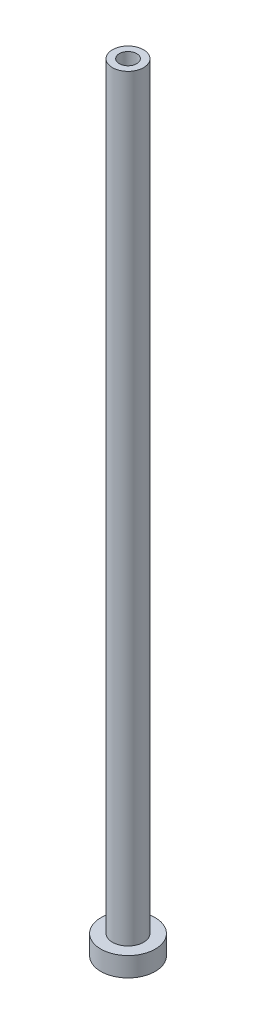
ISO-10303-21;
HEADER;
FILE_DESCRIPTION(('STEP AP214'),'2;1');
FILE_NAME('part.step','',(''),(''),'','','');
FILE_SCHEMA(('AUTOMOTIVE_DESIGN { 1 0 10303 214 1 1 1 1 }'));
ENDSEC;
DATA;
#1=APPLICATION_CONTEXT('core data for automotive mechanical design processes');
#2=APPLICATION_PROTOCOL_DEFINITION('international standard','automotive_design',2000,#1);
#3=PRODUCT_CONTEXT('',#1,'mechanical');
#4=PRODUCT('Part','Part','',(#3));
#5=PRODUCT_RELATED_PRODUCT_CATEGORY('part','',(#4));
#6=PRODUCT_DEFINITION_FORMATION('','',#4);
#7=PRODUCT_DEFINITION_CONTEXT('part definition',#1,'design');
#8=PRODUCT_DEFINITION('design','',#6,#7);
#9=PRODUCT_DEFINITION_SHAPE('','',#8);
#10=(LENGTH_UNIT() NAMED_UNIT(*) SI_UNIT(.MILLI.,.METRE.));
#11=(NAMED_UNIT(*) PLANE_ANGLE_UNIT() SI_UNIT($,.RADIAN.));
#12=(NAMED_UNIT(*) SI_UNIT($,.STERADIAN.) SOLID_ANGLE_UNIT());
#13=UNCERTAINTY_MEASURE_WITH_UNIT(LENGTH_MEASURE(1.E-05),#10,'distance_accuracy_value','');
#14=(GEOMETRIC_REPRESENTATION_CONTEXT(3) GLOBAL_UNCERTAINTY_ASSIGNED_CONTEXT((#13)) GLOBAL_UNIT_ASSIGNED_CONTEXT((#10,
#11,#12)) REPRESENTATION_CONTEXT('',''));
#15=CARTESIAN_POINT('',(0.,0.,0.));
#16=DIRECTION('',(0.,0.,1.));
#17=DIRECTION('',(1.,0.,0.));
#18=AXIS2_PLACEMENT_3D('',#15,#16,#17);
#19=CARTESIAN_POINT('',(0.,0.,0.));
#20=DIRECTION('',(0.,-1.,0.));
#21=DIRECTION('',(0.,0.,-1.));
#22=AXIS2_PLACEMENT_3D('',#19,#20,#21);
#23=CYLINDRICAL_SURFACE('',#22,7.);
#24=CARTESIAN_POINT('',(0.,-5.,0.));
#25=DIRECTION('',(0.,-1.,0.));
#26=DIRECTION('',(0.,0.,-1.));
#27=AXIS2_PLACEMENT_3D('',#24,#25,#26);
#28=CIRCLE('',#27,7.);
#29=CARTESIAN_POINT('',(0.,-5.,-7.));
#30=VERTEX_POINT('',#29);
#31=EDGE_CURVE('E42',#30,#30,#28,.T.);
#32=ORIENTED_EDGE('',*,*,#31,.F.);
#33=EDGE_LOOP('',(#32));
#34=FACE_BOUND('',#33,.T.);
#35=CARTESIAN_POINT('',(0.,0.,0.));
#36=DIRECTION('',(0.,-1.,0.));
#37=DIRECTION('',(0.,0.,-1.));
#38=AXIS2_PLACEMENT_3D('',#35,#36,#37);
#39=CIRCLE('',#38,7.);
#40=CARTESIAN_POINT('',(0.,0.,-7.));
#41=VERTEX_POINT('',#40);
#42=EDGE_CURVE('E9',#41,#41,#39,.T.);
#43=ORIENTED_EDGE('',*,*,#42,.T.);
#44=EDGE_LOOP('',(#43));
#45=FACE_BOUND('',#44,.T.);
#46=ADVANCED_FACE('F14',(#34,#45),#23,.T.);
#47=CARTESIAN_POINT('',(-7.,0.,0.));
#48=DIRECTION('',(0.,-1.,0.));
#49=DIRECTION('',(0.,0.,-1.));
#50=AXIS2_PLACEMENT_3D('',#47,#48,#49);
#51=PLANE('',#50);
#52=ORIENTED_EDGE('',*,*,#42,.F.);
#53=EDGE_LOOP('',(#52));
#54=FACE_BOUND('',#53,.T.);
#55=CARTESIAN_POINT('',(0.,0.,0.));
#56=DIRECTION('',(0.,-1.,0.));
#57=DIRECTION('',(0.,0.,-1.));
#58=AXIS2_PLACEMENT_3D('',#55,#56,#57);
#59=CIRCLE('',#58,4.);
#60=CARTESIAN_POINT('',(0.,0.,-4.));
#61=VERTEX_POINT('',#60);
#62=EDGE_CURVE('E20',#61,#61,#59,.T.);
#63=ORIENTED_EDGE('',*,*,#62,.T.);
#64=EDGE_LOOP('',(#63));
#65=FACE_BOUND('',#64,.T.);
#66=ADVANCED_FACE('F49',(#54,#65),#51,.F.);
#67=CARTESIAN_POINT('',(0.,0.,0.));
#68=DIRECTION('',(0.,-1.,0.));
#69=DIRECTION('',(0.,0.,-1.));
#70=AXIS2_PLACEMENT_3D('',#67,#68,#69);
#71=CYLINDRICAL_SURFACE('',#70,4.);
#72=ORIENTED_EDGE('',*,*,#62,.F.);
#73=EDGE_LOOP('',(#72));
#74=FACE_BOUND('',#73,.T.);
#75=CARTESIAN_POINT('',(0.,195.,0.));
#76=DIRECTION('',(0.,-1.,0.));
#77=DIRECTION('',(0.,0.,-1.));
#78=AXIS2_PLACEMENT_3D('',#75,#76,#77);
#79=CIRCLE('',#78,4.);
#80=CARTESIAN_POINT('',(0.,195.,-4.));
#81=VERTEX_POINT('',#80);
#82=EDGE_CURVE('E24',#81,#81,#79,.T.);
#83=ORIENTED_EDGE('',*,*,#82,.T.);
#84=EDGE_LOOP('',(#83));
#85=FACE_BOUND('',#84,.T.);
#86=ADVANCED_FACE('F55',(#74,#85),#71,.T.);
#87=CARTESIAN_POINT('',(-4.,195.,0.));
#88=DIRECTION('',(0.,-1.,0.));
#89=DIRECTION('',(0.,0.,-1.));
#90=AXIS2_PLACEMENT_3D('',#87,#88,#89);
#91=PLANE('',#90);
#92=ORIENTED_EDGE('',*,*,#82,.F.);
#93=EDGE_LOOP('',(#92));
#94=FACE_BOUND('',#93,.T.);
#95=CARTESIAN_POINT('',(0.,195.,0.));
#96=DIRECTION('',(0.,-1.,0.));
#97=DIRECTION('',(0.,0.,-1.));
#98=AXIS2_PLACEMENT_3D('',#95,#96,#97);
#99=CIRCLE('',#98,2.25);
#100=CARTESIAN_POINT('',(0.,195.,-2.25));
#101=VERTEX_POINT('',#100);
#102=EDGE_CURVE('E28',#101,#101,#99,.T.);
#103=ORIENTED_EDGE('',*,*,#102,.T.);
#104=EDGE_LOOP('',(#103));
#105=FACE_BOUND('',#104,.T.);
#106=ADVANCED_FACE('F61',(#94,#105),#91,.F.);
#107=CARTESIAN_POINT('',(0.,0.,0.));
#108=DIRECTION('',(0.,-1.,0.));
#109=DIRECTION('',(0.,0.,-1.));
#110=AXIS2_PLACEMENT_3D('',#107,#108,#109);
#111=CYLINDRICAL_SURFACE('',#110,2.25);
#112=ORIENTED_EDGE('',*,*,#102,.F.);
#113=EDGE_LOOP('',(#112));
#114=FACE_BOUND('',#113,.T.);
#115=CARTESIAN_POINT('',(0.,150.,0.));
#116=DIRECTION('',(0.,-1.,0.));
#117=DIRECTION('',(0.,0.,-1.));
#118=AXIS2_PLACEMENT_3D('',#115,#116,#117);
#119=CIRCLE('',#118,2.25);
#120=CARTESIAN_POINT('',(0.,150.,-2.25));
#121=VERTEX_POINT('',#120);
#122=EDGE_CURVE('E33',#121,#121,#119,.T.);
#123=ORIENTED_EDGE('',*,*,#122,.T.);
#124=EDGE_LOOP('',(#123));
#125=FACE_BOUND('',#124,.T.);
#126=ADVANCED_FACE('F67',(#114,#125),#111,.F.);
#127=CARTESIAN_POINT('',(0.,149.6,0.));
#128=DIRECTION('',(0.,-1.,0.));
#129=DIRECTION('',(0.,0.,-1.));
#130=AXIS2_PLACEMENT_3D('',#127,#128,#129);
#131=CONICAL_SURFACE('',#130,2.65,0.785398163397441);
#132=ORIENTED_EDGE('',*,*,#122,.F.);
#133=EDGE_LOOP('',(#132));
#134=FACE_BOUND('',#133,.T.);
#135=CARTESIAN_POINT('',(0.,149.6,0.));
#136=DIRECTION('',(0.,-1.,0.));
#137=DIRECTION('',(0.,0.,-1.));
#138=AXIS2_PLACEMENT_3D('',#135,#136,#137);
#139=CIRCLE('',#138,2.65);
#140=CARTESIAN_POINT('',(0.,149.6,-2.65));
#141=VERTEX_POINT('',#140);
#142=EDGE_CURVE('E36',#141,#141,#139,.T.);
#143=ORIENTED_EDGE('',*,*,#142,.T.);
#144=EDGE_LOOP('',(#143));
#145=FACE_BOUND('',#144,.T.);
#146=ADVANCED_FACE('F71',(#134,#145),#131,.F.);
#147=CARTESIAN_POINT('',(0.,0.,0.));
#148=DIRECTION('',(0.,-1.,0.));
#149=DIRECTION('',(0.,0.,-1.));
#150=AXIS2_PLACEMENT_3D('',#147,#148,#149);
#151=CYLINDRICAL_SURFACE('',#150,2.65);
#152=ORIENTED_EDGE('',*,*,#142,.F.);
#153=EDGE_LOOP('',(#152));
#154=FACE_BOUND('',#153,.T.);
#155=CARTESIAN_POINT('',(0.,-5.,0.));
#156=DIRECTION('',(0.,-1.,0.));
#157=DIRECTION('',(0.,0.,-1.));
#158=AXIS2_PLACEMENT_3D('',#155,#156,#157);
#159=CIRCLE('',#158,2.65);
#160=CARTESIAN_POINT('',(0.,-5.,-2.65));
#161=VERTEX_POINT('',#160);
#162=EDGE_CURVE('E39',#161,#161,#159,.T.);
#163=ORIENTED_EDGE('',*,*,#162,.T.);
#164=EDGE_LOOP('',(#163));
#165=FACE_BOUND('',#164,.T.);
#166=ADVANCED_FACE('F75',(#154,#165),#151,.F.);
#167=CARTESIAN_POINT('',(-2.65,-5.,0.));
#168=DIRECTION('',(0.,1.,0.));
#169=DIRECTION('',(0.,0.,1.));
#170=AXIS2_PLACEMENT_3D('',#167,#168,#169);
#171=PLANE('',#170);
#172=ORIENTED_EDGE('',*,*,#162,.F.);
#173=EDGE_LOOP('',(#172));
#174=FACE_BOUND('',#173,.T.);
#175=ORIENTED_EDGE('',*,*,#31,.T.);
#176=EDGE_LOOP('',(#175));
#177=FACE_BOUND('',#176,.T.);
#178=ADVANCED_FACE('F46',(#174,#177),#171,.F.);
#179=CLOSED_SHELL('',(#46,#66,#86,#106,#126,#146,#166,#178));
#180=MANIFOLD_SOLID_BREP('B1',#179);
#181=ADVANCED_BREP_SHAPE_REPRESENTATION('',(#18,#180),#14);
#182=SHAPE_DEFINITION_REPRESENTATION(#9,#181);
ENDSEC;
END-ISO-10303-21;
